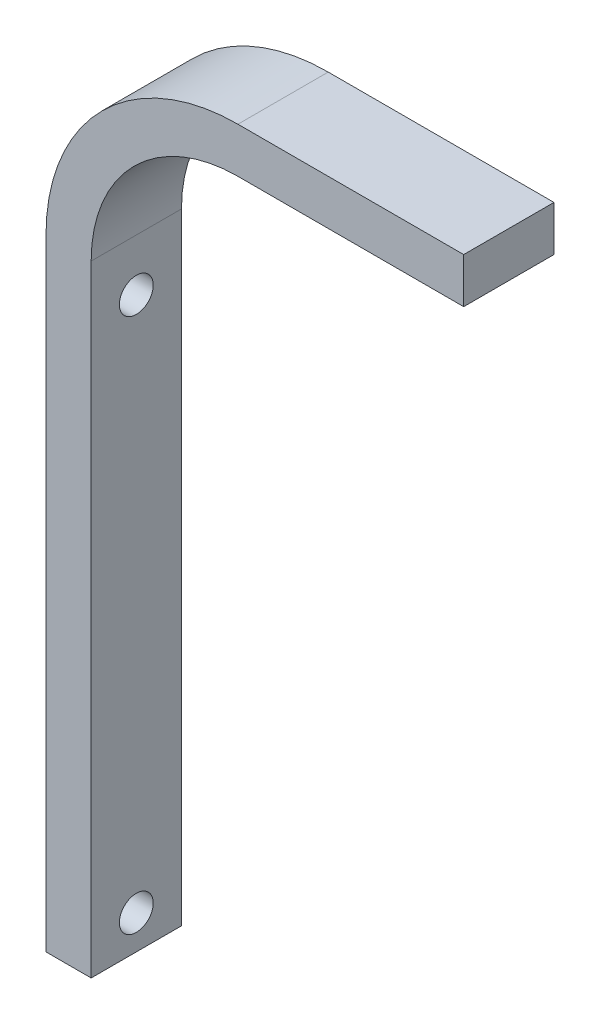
ISO-10303-21;
HEADER;
FILE_DESCRIPTION(('STEP AP214'),'2;1');
FILE_NAME('part.step','',(''),(''),'','','');
FILE_SCHEMA(('AUTOMOTIVE_DESIGN { 1 0 10303 214 1 1 1 1 }'));
ENDSEC;
DATA;
#1=APPLICATION_CONTEXT('core data for automotive mechanical design processes');
#2=APPLICATION_PROTOCOL_DEFINITION('international standard','automotive_design',2000,#1);
#3=PRODUCT_CONTEXT('',#1,'mechanical');
#4=PRODUCT('Part','Part','',(#3));
#5=PRODUCT_RELATED_PRODUCT_CATEGORY('part','',(#4));
#6=PRODUCT_DEFINITION_FORMATION('','',#4);
#7=PRODUCT_DEFINITION_CONTEXT('part definition',#1,'design');
#8=PRODUCT_DEFINITION('design','',#6,#7);
#9=PRODUCT_DEFINITION_SHAPE('','',#8);
#10=(LENGTH_UNIT() NAMED_UNIT(*) SI_UNIT(.MILLI.,.METRE.));
#11=(NAMED_UNIT(*) PLANE_ANGLE_UNIT() SI_UNIT($,.RADIAN.));
#12=(NAMED_UNIT(*) SI_UNIT($,.STERADIAN.) SOLID_ANGLE_UNIT());
#13=UNCERTAINTY_MEASURE_WITH_UNIT(LENGTH_MEASURE(1.E-05),#10,'distance_accuracy_value','');
#14=(GEOMETRIC_REPRESENTATION_CONTEXT(3) GLOBAL_UNCERTAINTY_ASSIGNED_CONTEXT((#13)) GLOBAL_UNIT_ASSIGNED_CONTEXT((#10,
#11,#12)) REPRESENTATION_CONTEXT('',''));
#15=CARTESIAN_POINT('',(0.,0.,0.));
#16=DIRECTION('',(0.,0.,1.));
#17=DIRECTION('',(1.,0.,0.));
#18=AXIS2_PLACEMENT_3D('',#15,#16,#17);
#19=CARTESIAN_POINT('',(4.,0.,8.));
#20=DIRECTION('',(0.,1.,0.));
#21=DIRECTION('',(0.,0.,1.));
#22=AXIS2_PLACEMENT_3D('',#19,#20,#21);
#23=PLANE('',#22);
#24=DIRECTION('',(1.,0.,0.));
#25=VECTOR('',#24,1.);
#26=CARTESIAN_POINT('',(4.,0.,0.));
#27=LINE('',#26,#25);
#28=CARTESIAN_POINT('',(0.,0.,0.));
#29=VERTEX_POINT('',#28);
#30=CARTESIAN_POINT('',(4.,0.,0.));
#31=VERTEX_POINT('',#30);
#32=EDGE_CURVE('E142',#29,#31,#27,.T.);
#33=ORIENTED_EDGE('',*,*,#32,.T.);
#34=DIRECTION('',(0.,0.,-1.));
#35=VECTOR('',#34,1.);
#36=CARTESIAN_POINT('',(4.,0.,8.));
#37=LINE('',#36,#35);
#38=CARTESIAN_POINT('',(4.,0.,8.));
#39=VERTEX_POINT('',#38);
#40=EDGE_CURVE('E11',#39,#31,#37,.T.);
#41=ORIENTED_EDGE('',*,*,#40,.F.);
#42=DIRECTION('',(1.,0.,0.));
#43=VECTOR('',#42,1.);
#44=CARTESIAN_POINT('',(4.,0.,8.));
#45=LINE('',#44,#43);
#46=CARTESIAN_POINT('',(0.,0.,8.));
#47=VERTEX_POINT('',#46);
#48=EDGE_CURVE('E165',#47,#39,#45,.T.);
#49=ORIENTED_EDGE('',*,*,#48,.F.);
#50=DIRECTION('',(0.,0.,-1.));
#51=VECTOR('',#50,1.);
#52=CARTESIAN_POINT('',(0.,0.,8.));
#53=LINE('',#52,#51);
#54=EDGE_CURVE('E138',#47,#29,#53,.T.);
#55=ORIENTED_EDGE('',*,*,#54,.T.);
#56=EDGE_LOOP('',(#33,#41,#49,#55));
#57=FACE_BOUND('',#56,.T.);
#58=ADVANCED_FACE('F39',(#57),#23,.F.);
#59=CARTESIAN_POINT('',(4.,55.,8.));
#60=DIRECTION('',(-1.,0.,0.));
#61=DIRECTION('',(0.,-1.,0.));
#62=AXIS2_PLACEMENT_3D('',#59,#60,#61);
#63=PLANE('',#62);
#64=CARTESIAN_POINT('',(4.,3.,4.));
#65=DIRECTION('',(-1.,0.,0.));
#66=DIRECTION('',(0.,-1.,0.));
#67=AXIS2_PLACEMENT_3D('',#64,#65,#66);
#68=CIRCLE('',#67,1.5);
#69=CARTESIAN_POINT('',(4.,1.5,4.));
#70=VERTEX_POINT('',#69);
#71=EDGE_CURVE('E147',#70,#70,#68,.T.);
#72=ORIENTED_EDGE('',*,*,#71,.T.);
#73=EDGE_LOOP('',(#72));
#74=FACE_BOUND('',#73,.T.);
#75=CARTESIAN_POINT('',(4.,50.4086759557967,4.));
#76=DIRECTION('',(-1.,0.,0.));
#77=DIRECTION('',(0.,-1.,0.));
#78=AXIS2_PLACEMENT_3D('',#75,#76,#77);
#79=CIRCLE('',#78,1.5);
#80=CARTESIAN_POINT('',(4.,48.9086759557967,4.));
#81=VERTEX_POINT('',#80);
#82=EDGE_CURVE('E185',#81,#81,#79,.T.);
#83=ORIENTED_EDGE('',*,*,#82,.T.);
#84=EDGE_LOOP('',(#83));
#85=FACE_BOUND('',#84,.T.);
#86=DIRECTION('',(0.,1.,0.));
#87=VECTOR('',#86,1.);
#88=CARTESIAN_POINT('',(4.,55.,0.));
#89=LINE('',#88,#87);
#90=CARTESIAN_POINT('',(4.,55.,0.));
#91=VERTEX_POINT('',#90);
#92=EDGE_CURVE('E146',#31,#91,#89,.T.);
#93=ORIENTED_EDGE('',*,*,#92,.T.);
#94=DIRECTION('',(0.,0.,-1.));
#95=VECTOR('',#94,1.);
#96=CARTESIAN_POINT('',(4.,55.,8.));
#97=LINE('',#96,#95);
#98=CARTESIAN_POINT('',(4.,55.,8.));
#99=VERTEX_POINT('',#98);
#100=EDGE_CURVE('E49',#99,#91,#97,.T.);
#101=ORIENTED_EDGE('',*,*,#100,.F.);
#102=DIRECTION('',(0.,1.,0.));
#103=VECTOR('',#102,1.);
#104=CARTESIAN_POINT('',(4.,55.,8.));
#105=LINE('',#104,#103);
#106=EDGE_CURVE('E101',#39,#99,#105,.T.);
#107=ORIENTED_EDGE('',*,*,#106,.F.);
#108=ORIENTED_EDGE('',*,*,#40,.T.);
#109=EDGE_LOOP('',(#93,#101,#107,#108));
#110=FACE_BOUND('',#109,.T.);
#111=ADVANCED_FACE('F238',(#74,#85,#110),#63,.F.);
#112=CARTESIAN_POINT('',(17.,55.,8.));
#113=DIRECTION('',(0.,0.,-1.));
#114=DIRECTION('',(-1.,0.,0.));
#115=AXIS2_PLACEMENT_3D('',#112,#113,#114);
#116=CYLINDRICAL_SURFACE('',#115,13.);
#117=CARTESIAN_POINT('',(17.,55.,0.));
#118=DIRECTION('',(0.,0.,-1.));
#119=DIRECTION('',(1.,0.,0.));
#120=AXIS2_PLACEMENT_3D('',#117,#118,#119);
#121=CIRCLE('',#120,13.);
#122=CARTESIAN_POINT('',(17.0000000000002,68.,0.));
#123=VERTEX_POINT('',#122);
#124=EDGE_CURVE('E150',#91,#123,#121,.T.);
#125=ORIENTED_EDGE('',*,*,#124,.T.);
#126=DIRECTION('',(0.,0.,-1.));
#127=VECTOR('',#126,1.);
#128=CARTESIAN_POINT('',(17.0000000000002,68.,8.));
#129=LINE('',#128,#127);
#130=CARTESIAN_POINT('',(17.0000000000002,68.,8.));
#131=VERTEX_POINT('',#130);
#132=EDGE_CURVE('E176',#131,#123,#129,.T.);
#133=ORIENTED_EDGE('',*,*,#132,.F.);
#134=CARTESIAN_POINT('',(17.,55.,8.));
#135=DIRECTION('',(0.,0.,-1.));
#136=DIRECTION('',(1.,0.,0.));
#137=AXIS2_PLACEMENT_3D('',#134,#135,#136);
#138=CIRCLE('',#137,13.);
#139=EDGE_CURVE('E203',#99,#131,#138,.T.);
#140=ORIENTED_EDGE('',*,*,#139,.F.);
#141=ORIENTED_EDGE('',*,*,#100,.T.);
#142=EDGE_LOOP('',(#125,#133,#140,#141));
#143=FACE_BOUND('',#142,.T.);
#144=ADVANCED_FACE('F242',(#143),#116,.F.);
#145=CARTESIAN_POINT('',(37.,68.,8.));
#146=DIRECTION('',(0.,1.,0.));
#147=DIRECTION('',(0.,0.,1.));
#148=AXIS2_PLACEMENT_3D('',#145,#146,#147);
#149=PLANE('',#148);
#150=DIRECTION('',(1.,0.,0.));
#151=VECTOR('',#150,1.);
#152=CARTESIAN_POINT('',(37.,68.,0.));
#153=LINE('',#152,#151);
#154=CARTESIAN_POINT('',(37.,68.,0.));
#155=VERTEX_POINT('',#154);
#156=EDGE_CURVE('E153',#123,#155,#153,.T.);
#157=ORIENTED_EDGE('',*,*,#156,.T.);
#158=DIRECTION('',(0.,0.,-1.));
#159=VECTOR('',#158,1.);
#160=CARTESIAN_POINT('',(37.,68.,8.));
#161=LINE('',#160,#159);
#162=CARTESIAN_POINT('',(37.,68.,8.));
#163=VERTEX_POINT('',#162);
#164=EDGE_CURVE('E172',#163,#155,#161,.T.);
#165=ORIENTED_EDGE('',*,*,#164,.F.);
#166=DIRECTION('',(1.,0.,0.));
#167=VECTOR('',#166,1.);
#168=CARTESIAN_POINT('',(37.,68.,8.));
#169=LINE('',#168,#167);
#170=EDGE_CURVE('E206',#131,#163,#169,.T.);
#171=ORIENTED_EDGE('',*,*,#170,.F.);
#172=ORIENTED_EDGE('',*,*,#132,.T.);
#173=EDGE_LOOP('',(#157,#165,#171,#172));
#174=FACE_BOUND('',#173,.T.);
#175=ADVANCED_FACE('F214',(#174),#149,.F.);
#176=CARTESIAN_POINT('',(37.,72.,8.));
#177=DIRECTION('',(-1.,0.,0.));
#178=DIRECTION('',(0.,0.,1.));
#179=AXIS2_PLACEMENT_3D('',#176,#177,#178);
#180=PLANE('',#179);
#181=DIRECTION('',(0.,1.,0.));
#182=VECTOR('',#181,1.);
#183=CARTESIAN_POINT('',(37.,72.,0.));
#184=LINE('',#183,#182);
#185=CARTESIAN_POINT('',(37.,72.,0.));
#186=VERTEX_POINT('',#185);
#187=EDGE_CURVE('E156',#155,#186,#184,.T.);
#188=ORIENTED_EDGE('',*,*,#187,.T.);
#189=DIRECTION('',(0.,0.,-1.));
#190=VECTOR('',#189,1.);
#191=CARTESIAN_POINT('',(37.,72.,8.));
#192=LINE('',#191,#190);
#193=CARTESIAN_POINT('',(37.,72.,8.));
#194=VERTEX_POINT('',#193);
#195=EDGE_CURVE('E131',#194,#186,#192,.T.);
#196=ORIENTED_EDGE('',*,*,#195,.F.);
#197=DIRECTION('',(0.,1.,0.));
#198=VECTOR('',#197,1.);
#199=CARTESIAN_POINT('',(37.,72.,8.));
#200=LINE('',#199,#198);
#201=EDGE_CURVE('E120',#163,#194,#200,.T.);
#202=ORIENTED_EDGE('',*,*,#201,.F.);
#203=ORIENTED_EDGE('',*,*,#164,.T.);
#204=EDGE_LOOP('',(#188,#196,#202,#203));
#205=FACE_BOUND('',#204,.T.);
#206=ADVANCED_FACE('F218',(#205),#180,.F.);
#207=CARTESIAN_POINT('',(17.,72.,8.));
#208=DIRECTION('',(0.,-1.,0.));
#209=DIRECTION('',(0.,0.,-1.));
#210=AXIS2_PLACEMENT_3D('',#207,#208,#209);
#211=PLANE('',#210);
#212=DIRECTION('',(-1.,0.,0.));
#213=VECTOR('',#212,1.);
#214=CARTESIAN_POINT('',(17.,72.,0.));
#215=LINE('',#214,#213);
#216=CARTESIAN_POINT('',(17.,72.,0.));
#217=VERTEX_POINT('',#216);
#218=EDGE_CURVE('E129',#186,#217,#215,.T.);
#219=ORIENTED_EDGE('',*,*,#218,.T.);
#220=DIRECTION('',(0.,0.,-1.));
#221=VECTOR('',#220,1.);
#222=CARTESIAN_POINT('',(17.,72.,8.));
#223=LINE('',#222,#221);
#224=CARTESIAN_POINT('',(17.,72.,8.));
#225=VERTEX_POINT('',#224);
#226=EDGE_CURVE('E126',#225,#217,#223,.T.);
#227=ORIENTED_EDGE('',*,*,#226,.F.);
#228=DIRECTION('',(-1.,0.,0.));
#229=VECTOR('',#228,1.);
#230=CARTESIAN_POINT('',(17.,72.,8.));
#231=LINE('',#230,#229);
#232=EDGE_CURVE('E114',#194,#225,#231,.T.);
#233=ORIENTED_EDGE('',*,*,#232,.F.);
#234=ORIENTED_EDGE('',*,*,#195,.T.);
#235=EDGE_LOOP('',(#219,#227,#233,#234));
#236=FACE_BOUND('',#235,.T.);
#237=ADVANCED_FACE('F127',(#236),#211,.F.);
#238=CARTESIAN_POINT('',(17.,55.,8.));
#239=DIRECTION('',(0.,0.,-1.));
#240=DIRECTION('',(-1.,0.,0.));
#241=AXIS2_PLACEMENT_3D('',#238,#239,#240);
#242=CYLINDRICAL_SURFACE('',#241,17.);
#243=CARTESIAN_POINT('',(17.,55.,0.));
#244=DIRECTION('',(0.,0.,1.));
#245=DIRECTION('',(-1.,0.,0.));
#246=AXIS2_PLACEMENT_3D('',#243,#244,#245);
#247=CIRCLE('',#246,17.);
#248=CARTESIAN_POINT('',(0.,55.,0.));
#249=VERTEX_POINT('',#248);
#250=EDGE_CURVE('E87',#217,#249,#247,.T.);
#251=ORIENTED_EDGE('',*,*,#250,.T.);
#252=DIRECTION('',(0.,0.,-1.));
#253=VECTOR('',#252,1.);
#254=CARTESIAN_POINT('',(0.,55.,8.));
#255=LINE('',#254,#253);
#256=CARTESIAN_POINT('',(0.,55.,8.));
#257=VERTEX_POINT('',#256);
#258=EDGE_CURVE('E132',#257,#249,#255,.T.);
#259=ORIENTED_EDGE('',*,*,#258,.F.);
#260=CARTESIAN_POINT('',(17.,55.,8.));
#261=DIRECTION('',(0.,0.,1.));
#262=DIRECTION('',(-1.,0.,0.));
#263=AXIS2_PLACEMENT_3D('',#260,#261,#262);
#264=CIRCLE('',#263,17.);
#265=EDGE_CURVE('E118',#225,#257,#264,.T.);
#266=ORIENTED_EDGE('',*,*,#265,.F.);
#267=ORIENTED_EDGE('',*,*,#226,.T.);
#268=EDGE_LOOP('',(#251,#259,#266,#267));
#269=FACE_BOUND('',#268,.T.);
#270=ADVANCED_FACE('F134',(#269),#242,.T.);
#271=CARTESIAN_POINT('',(0.,0.,8.));
#272=DIRECTION('',(1.,0.,0.));
#273=DIRECTION('',(0.,0.,-1.));
#274=AXIS2_PLACEMENT_3D('',#271,#272,#273);
#275=PLANE('',#274);
#276=CARTESIAN_POINT('',(0.,3.,4.));
#277=DIRECTION('',(1.,0.,0.));
#278=DIRECTION('',(0.,0.,-1.));
#279=AXIS2_PLACEMENT_3D('',#276,#277,#278);
#280=CIRCLE('',#279,1.5);
#281=CARTESIAN_POINT('',(0.,3.,2.5));
#282=VERTEX_POINT('',#281);
#283=EDGE_CURVE('E42',#282,#282,#280,.T.);
#284=ORIENTED_EDGE('',*,*,#283,.T.);
#285=EDGE_LOOP('',(#284));
#286=FACE_BOUND('',#285,.T.);
#287=CARTESIAN_POINT('',(0.,50.4086759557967,4.));
#288=DIRECTION('',(1.,0.,0.));
#289=DIRECTION('',(0.,0.,-1.));
#290=AXIS2_PLACEMENT_3D('',#287,#288,#289);
#291=CIRCLE('',#290,1.5);
#292=CARTESIAN_POINT('',(0.,50.4086759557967,2.5));
#293=VERTEX_POINT('',#292);
#294=EDGE_CURVE('E182',#293,#293,#291,.T.);
#295=ORIENTED_EDGE('',*,*,#294,.T.);
#296=EDGE_LOOP('',(#295));
#297=FACE_BOUND('',#296,.T.);
#298=DIRECTION('',(0.,-1.,0.));
#299=VECTOR('',#298,1.);
#300=CARTESIAN_POINT('',(0.,0.,0.));
#301=LINE('',#300,#299);
#302=EDGE_CURVE('E93',#249,#29,#301,.T.);
#303=ORIENTED_EDGE('',*,*,#302,.T.);
#304=ORIENTED_EDGE('',*,*,#54,.F.);
#305=DIRECTION('',(0.,-1.,0.));
#306=VECTOR('',#305,1.);
#307=CARTESIAN_POINT('',(0.,0.,8.));
#308=LINE('',#307,#306);
#309=EDGE_CURVE('E58',#257,#47,#308,.T.);
#310=ORIENTED_EDGE('',*,*,#309,.F.);
#311=ORIENTED_EDGE('',*,*,#258,.T.);
#312=EDGE_LOOP('',(#303,#304,#310,#311));
#313=FACE_BOUND('',#312,.T.);
#314=ADVANCED_FACE('F226',(#286,#297,#313),#275,.F.);
#315=CARTESIAN_POINT('',(17.,55.,8.));
#316=DIRECTION('',(0.,0.,-1.));
#317=DIRECTION('',(-1.,0.,0.));
#318=AXIS2_PLACEMENT_3D('',#315,#316,#317);
#319=PLANE('',#318);
#320=ORIENTED_EDGE('',*,*,#48,.T.);
#321=ORIENTED_EDGE('',*,*,#106,.T.);
#322=ORIENTED_EDGE('',*,*,#139,.T.);
#323=ORIENTED_EDGE('',*,*,#170,.T.);
#324=ORIENTED_EDGE('',*,*,#201,.T.);
#325=ORIENTED_EDGE('',*,*,#232,.T.);
#326=ORIENTED_EDGE('',*,*,#265,.T.);
#327=ORIENTED_EDGE('',*,*,#309,.T.);
#328=EDGE_LOOP('',(#320,#321,#322,#323,#324,#325,#326,#327));
#329=FACE_BOUND('',#328,.T.);
#330=ADVANCED_FACE('F116',(#329),#319,.F.);
#331=CARTESIAN_POINT('',(17.,55.,0.));
#332=DIRECTION('',(0.,0.,-1.));
#333=DIRECTION('',(-1.,0.,0.));
#334=AXIS2_PLACEMENT_3D('',#331,#332,#333);
#335=PLANE('',#334);
#336=ORIENTED_EDGE('',*,*,#32,.F.);
#337=ORIENTED_EDGE('',*,*,#302,.F.);
#338=ORIENTED_EDGE('',*,*,#250,.F.);
#339=ORIENTED_EDGE('',*,*,#218,.F.);
#340=ORIENTED_EDGE('',*,*,#187,.F.);
#341=ORIENTED_EDGE('',*,*,#156,.F.);
#342=ORIENTED_EDGE('',*,*,#124,.F.);
#343=ORIENTED_EDGE('',*,*,#92,.F.);
#344=EDGE_LOOP('',(#336,#337,#338,#339,#340,#341,#342,#343));
#345=FACE_BOUND('',#344,.T.);
#346=ADVANCED_FACE('F221',(#345),#335,.T.);
#347=CARTESIAN_POINT('',(37.,50.4086759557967,4.));
#348=DIRECTION('',(-1.,0.,0.));
#349=DIRECTION('',(0.,0.,1.));
#350=AXIS2_PLACEMENT_3D('',#347,#348,#349);
#351=CYLINDRICAL_SURFACE('',#350,1.5);
#352=ORIENTED_EDGE('',*,*,#294,.F.);
#353=EDGE_LOOP('',(#352));
#354=FACE_BOUND('',#353,.T.);
#355=ORIENTED_EDGE('',*,*,#82,.F.);
#356=EDGE_LOOP('',(#355));
#357=FACE_BOUND('',#356,.T.);
#358=ADVANCED_FACE('F278',(#354,#357),#351,.F.);
#359=CARTESIAN_POINT('',(37.,3.,4.));
#360=DIRECTION('',(-1.,0.,0.));
#361=DIRECTION('',(0.,0.,1.));
#362=AXIS2_PLACEMENT_3D('',#359,#360,#361);
#363=CYLINDRICAL_SURFACE('',#362,1.5);
#364=ORIENTED_EDGE('',*,*,#283,.F.);
#365=EDGE_LOOP('',(#364));
#366=FACE_BOUND('',#365,.T.);
#367=ORIENTED_EDGE('',*,*,#71,.F.);
#368=EDGE_LOOP('',(#367));
#369=FACE_BOUND('',#368,.T.);
#370=ADVANCED_FACE('F296',(#366,#369),#363,.F.);
#371=CLOSED_SHELL('',(#58,#111,#144,#175,#206,#237,#270,#314,#330,#346,#358,#370));
#372=MANIFOLD_SOLID_BREP('B2',#371);
#373=ADVANCED_BREP_SHAPE_REPRESENTATION('',(#18,#372),#14);
#374=SHAPE_DEFINITION_REPRESENTATION(#9,#373);
ENDSEC;
END-ISO-10303-21;
